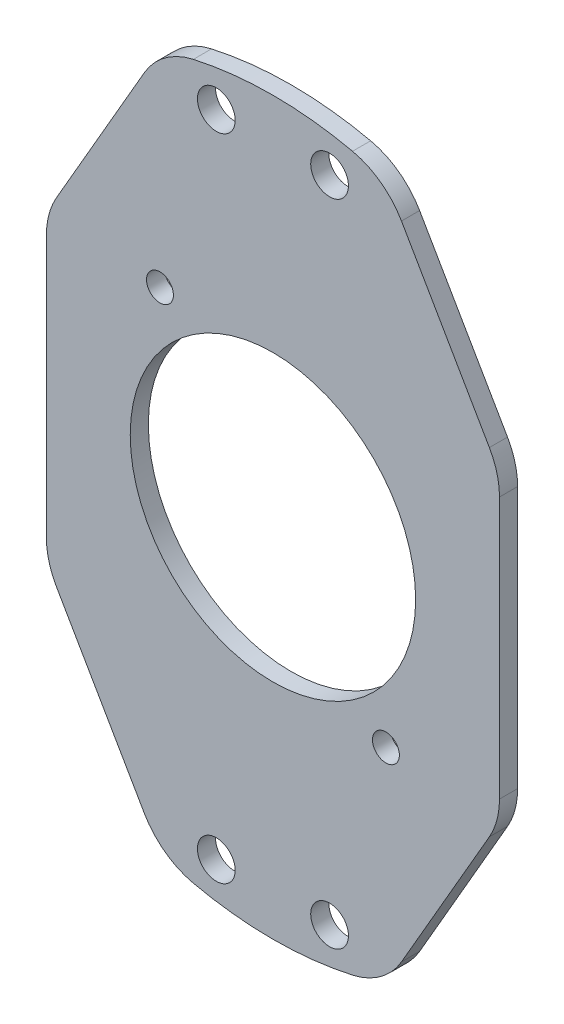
from build123d import *

# Parameters (mm, degrees)
SKETCH1_R             = 1.5875
SKETCH1_R_2           = 12
BOSS_EXTRUDE1_DEPTH   = 1.524
F_4_40_TAPPED_HOLE1_D = 2.2606
CUT_EXTRUDE2_DEPTH    = 37.191212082
FILLET1_R             = 6.35


with BuildPart() as part:
    # Sketch1 → Boss-Extrude1 (new body)
    with BuildSketch(Plane.XY):
        with BuildLine():
            Line((-19.05, 23.745943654), (-19.05, -23.745943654))
            ThreePointArc((-19.05, -23.745943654), (-18.971716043, -24.082360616), (-18.752949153, -24.349654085))
            ThreePointArc((-18.752949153, -24.349654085), (0, -30.734), (18.752949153, -24.349654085))
            ThreePointArc((18.752949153, -24.349654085), (18.971716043, -24.082360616), (19.05, -23.745943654))
            Line((19.05, -23.745943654), (19.05, 23.745943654))
            ThreePointArc((19.05, 23.745943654), (18.971716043, 24.082360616), (18.752949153, 24.349654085))
            ThreePointArc((18.752949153, 24.349654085), (0, 30.734), (-18.752949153, 24.349654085))
            ThreePointArc((-18.752949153, 24.349654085), (-18.971716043, 24.082360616), (-19.05, 23.745943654))
        make_face()
        with Locations(Location((-4.7625, 27.305, 0), (0, 0, 180))):
            Circle(SKETCH1_R, mode=Mode.SUBTRACT)
        with Locations(Location((4.7625, 27.305, 0), (0, 0, 180))):
            Circle(SKETCH1_R, mode=Mode.SUBTRACT)
        with Locations(Location((4.7625, -27.305, 0), (0, 0, 180))):
            Circle(SKETCH1_R, mode=Mode.SUBTRACT)
        with Locations(Location((-4.7625, -27.305, 0), (0, 0, 180))):
            Circle(SKETCH1_R, mode=Mode.SUBTRACT)
        with Locations(Location((0, 0, 0), (0, 0, 180))):
            Circle(SKETCH1_R_2, mode=Mode.SUBTRACT)
    extrude(amount=BOSS_EXTRUDE1_DEPTH)

    # 4-40 Tapped Hole1 (through all)
    with Locations(Plane.XY.offset(1.524)):
        with Locations((-9.4996, 11.9888), (9.4996, -12.0142)):
            Hole(F_4_40_TAPPED_HOLE1_D / 2)

    # Sketch5 → Cut-Extrude2 (cut, through all)
    with BuildSketch(Plane.XY.offset(1.524)):
        Polygon((7.141213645, 33.326623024), (19.05, 12.7), (19.05, 33.326623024), align=None)
        Polygon((-19.05, 33.326623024), (-7.141213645, 33.326623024), (-19.05, 12.7), align=None)
        Polygon((-7.141213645, -33.326623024), (-19.05, -12.7), (-19.05, -33.326623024), align=None)
        Polygon((19.05, -33.326623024), (7.141213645, -33.326623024), (19.05, -12.7), align=None)
    extrude(amount=-CUT_EXTRUDE2_DEPTH, mode=Mode.SUBTRACT)

    # Fillet1
    fillet1_edges = [part.edges().sort_by_distance(p)[0] for p in [
        (9.508659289, 29.226086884, 0.762),
        (-9.508659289, 29.226086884, 0.762),
        (-9.508659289, -29.226086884, 0.762),
        (19.05, -12.7, 0.762),
        (9.508659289, -29.226086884, 0.762),
        (-19.05, -12.7, 0.762),
        (-19.05, 12.7, 0.762),
        (19.05, 12.7, 0.762),
    ]]
    fillet(fillet1_edges, radius=FILLET1_R)


solid = part.part
